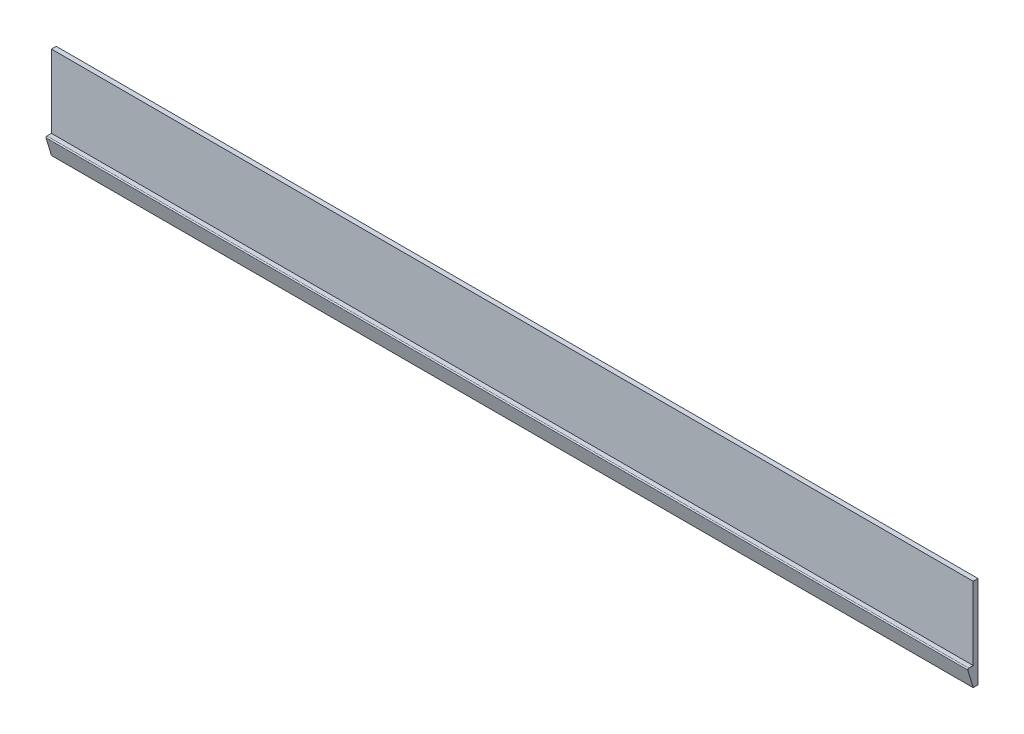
ISO-10303-21;
HEADER;
FILE_DESCRIPTION(('STEP AP214'),'2;1');
FILE_NAME('part.step','',(''),(''),'','','');
FILE_SCHEMA(('AUTOMOTIVE_DESIGN { 1 0 10303 214 1 1 1 1 }'));
ENDSEC;
DATA;
#1=APPLICATION_CONTEXT('core data for automotive mechanical design processes');
#2=APPLICATION_PROTOCOL_DEFINITION('international standard','automotive_design',2000,#1);
#3=PRODUCT_CONTEXT('',#1,'mechanical');
#4=PRODUCT('Part','Part','',(#3));
#5=PRODUCT_RELATED_PRODUCT_CATEGORY('part','',(#4));
#6=PRODUCT_DEFINITION_FORMATION('','',#4);
#7=PRODUCT_DEFINITION_CONTEXT('part definition',#1,'design');
#8=PRODUCT_DEFINITION('design','',#6,#7);
#9=PRODUCT_DEFINITION_SHAPE('','',#8);
#10=(LENGTH_UNIT() NAMED_UNIT(*) SI_UNIT(.MILLI.,.METRE.));
#11=(NAMED_UNIT(*) PLANE_ANGLE_UNIT() SI_UNIT($,.RADIAN.));
#12=(NAMED_UNIT(*) SI_UNIT($,.STERADIAN.) SOLID_ANGLE_UNIT());
#13=UNCERTAINTY_MEASURE_WITH_UNIT(LENGTH_MEASURE(1.E-05),#10,'distance_accuracy_value','');
#14=(GEOMETRIC_REPRESENTATION_CONTEXT(3) GLOBAL_UNCERTAINTY_ASSIGNED_CONTEXT((#13)) GLOBAL_UNIT_ASSIGNED_CONTEXT((#10,
#11,#12)) REPRESENTATION_CONTEXT('',''));
#15=CARTESIAN_POINT('',(0.,0.,0.));
#16=DIRECTION('',(0.,0.,1.));
#17=DIRECTION('',(1.,0.,0.));
#18=AXIS2_PLACEMENT_3D('',#15,#16,#17);
#19=CARTESIAN_POINT('',(240.,24.,-1.25));
#20=DIRECTION('',(0.,0.,1.));
#21=DIRECTION('',(0.,-1.,0.));
#22=AXIS2_PLACEMENT_3D('',#19,#20,#21);
#23=PLANE('',#22);
#24=DIRECTION('',(0.,1.,0.));
#25=VECTOR('',#24,1.);
#26=CARTESIAN_POINT('',(-240.,24.,-1.25));
#27=LINE('',#26,#25);
#28=CARTESIAN_POINT('',(-240.,-24.,-1.25));
#29=VERTEX_POINT('',#28);
#30=CARTESIAN_POINT('',(-240.,24.,-1.25));
#31=VERTEX_POINT('',#30);
#32=EDGE_CURVE('E123',#29,#31,#27,.T.);
#33=ORIENTED_EDGE('',*,*,#32,.T.);
#34=DIRECTION('',(-1.,0.,0.));
#35=VECTOR('',#34,1.);
#36=CARTESIAN_POINT('',(240.,24.,-1.25));
#37=LINE('',#36,#35);
#38=CARTESIAN_POINT('',(240.,24.,-1.25));
#39=VERTEX_POINT('',#38);
#40=EDGE_CURVE('E102',#39,#31,#37,.T.);
#41=ORIENTED_EDGE('',*,*,#40,.F.);
#42=DIRECTION('',(0.,1.,0.));
#43=VECTOR('',#42,1.);
#44=CARTESIAN_POINT('',(240.,24.,-1.25));
#45=LINE('',#44,#43);
#46=CARTESIAN_POINT('',(240.,-24.,-1.25));
#47=VERTEX_POINT('',#46);
#48=EDGE_CURVE('E110',#47,#39,#45,.T.);
#49=ORIENTED_EDGE('',*,*,#48,.F.);
#50=DIRECTION('',(-1.,0.,0.));
#51=VECTOR('',#50,1.);
#52=CARTESIAN_POINT('',(240.,-24.,-1.25));
#53=LINE('',#52,#51);
#54=EDGE_CURVE('E144',#47,#29,#53,.T.);
#55=ORIENTED_EDGE('',*,*,#54,.T.);
#56=EDGE_LOOP('',(#33,#41,#49,#55));
#57=FACE_BOUND('',#56,.T.);
#58=ADVANCED_FACE('F38',(#57),#23,.F.);
#59=CARTESIAN_POINT('',(240.,24.,1.25));
#60=DIRECTION('',(0.,-1.,0.));
#61=DIRECTION('',(0.,0.,-1.));
#62=AXIS2_PLACEMENT_3D('',#59,#60,#61);
#63=PLANE('',#62);
#64=DIRECTION('',(0.,0.,1.));
#65=VECTOR('',#64,1.);
#66=CARTESIAN_POINT('',(-240.,24.,1.25));
#67=LINE('',#66,#65);
#68=CARTESIAN_POINT('',(-240.,24.,1.25));
#69=VERTEX_POINT('',#68);
#70=EDGE_CURVE('E158',#31,#69,#67,.T.);
#71=ORIENTED_EDGE('',*,*,#70,.T.);
#72=DIRECTION('',(-1.,0.,0.));
#73=VECTOR('',#72,1.);
#74=CARTESIAN_POINT('',(240.,24.,1.25));
#75=LINE('',#74,#73);
#76=CARTESIAN_POINT('',(240.,24.,1.25));
#77=VERTEX_POINT('',#76);
#78=EDGE_CURVE('E105',#77,#69,#75,.T.);
#79=ORIENTED_EDGE('',*,*,#78,.F.);
#80=DIRECTION('',(0.,0.,1.));
#81=VECTOR('',#80,1.);
#82=CARTESIAN_POINT('',(240.,24.,1.25));
#83=LINE('',#82,#81);
#84=EDGE_CURVE('E98',#39,#77,#83,.T.);
#85=ORIENTED_EDGE('',*,*,#84,.F.);
#86=ORIENTED_EDGE('',*,*,#40,.T.);
#87=EDGE_LOOP('',(#71,#79,#85,#86));
#88=FACE_BOUND('',#87,.T.);
#89=ADVANCED_FACE('F100',(#88),#63,.F.);
#90=CARTESIAN_POINT('',(240.,24.,1.25));
#91=DIRECTION('',(0.,0.,-1.));
#92=DIRECTION('',(0.,1.,0.));
#93=AXIS2_PLACEMENT_3D('',#90,#91,#92);
#94=PLANE('',#93);
#95=DIRECTION('',(0.,-1.,0.));
#96=VECTOR('',#95,1.);
#97=CARTESIAN_POINT('',(-240.,24.,1.25));
#98=LINE('',#97,#96);
#99=CARTESIAN_POINT('',(-240.,-14.,1.25));
#100=VERTEX_POINT('',#99);
#101=EDGE_CURVE('E155',#69,#100,#98,.T.);
#102=ORIENTED_EDGE('',*,*,#101,.T.);
#103=DIRECTION('',(-1.,0.,0.));
#104=VECTOR('',#103,1.);
#105=CARTESIAN_POINT('',(240.,-14.,1.25));
#106=LINE('',#105,#104);
#107=CARTESIAN_POINT('',(240.,-14.,1.25));
#108=VERTEX_POINT('',#107);
#109=EDGE_CURVE('E131',#108,#100,#106,.T.);
#110=ORIENTED_EDGE('',*,*,#109,.F.);
#111=DIRECTION('',(0.,-1.,0.));
#112=VECTOR('',#111,1.);
#113=CARTESIAN_POINT('',(240.,24.,1.25));
#114=LINE('',#113,#112);
#115=EDGE_CURVE('E109',#77,#108,#114,.T.);
#116=ORIENTED_EDGE('',*,*,#115,.F.);
#117=ORIENTED_EDGE('',*,*,#78,.T.);
#118=EDGE_LOOP('',(#102,#110,#116,#117));
#119=FACE_BOUND('',#118,.T.);
#120=ADVANCED_FACE('F175',(#119),#94,.F.);
#121=CARTESIAN_POINT('',(240.,-14.,1.25));
#122=DIRECTION('',(0.,-1.,0.));
#123=DIRECTION('',(0.,0.,-1.));
#124=AXIS2_PLACEMENT_3D('',#121,#122,#123);
#125=PLANE('',#124);
#126=DIRECTION('',(0.,0.,1.));
#127=VECTOR('',#126,1.);
#128=CARTESIAN_POINT('',(-240.,-14.,1.25));
#129=LINE('',#128,#127);
#130=CARTESIAN_POINT('',(-240.,-14.,3.57798467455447));
#131=VERTEX_POINT('',#130);
#132=EDGE_CURVE('E152',#100,#131,#129,.T.);
#133=ORIENTED_EDGE('',*,*,#132,.T.);
#134=DIRECTION('',(-1.,0.,0.));
#135=VECTOR('',#134,1.);
#136=CARTESIAN_POINT('',(240.,-14.,3.57798467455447));
#137=LINE('',#136,#135);
#138=CARTESIAN_POINT('',(240.,-14.,3.57798467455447));
#139=VERTEX_POINT('',#138);
#140=EDGE_CURVE('E47',#131,#139,#137,.F.);
#141=ORIENTED_EDGE('',*,*,#140,.T.);
#142=DIRECTION('',(0.,0.,1.));
#143=VECTOR('',#142,1.);
#144=CARTESIAN_POINT('',(240.,-14.,1.25));
#145=LINE('',#144,#143);
#146=EDGE_CURVE('E168',#108,#139,#145,.T.);
#147=ORIENTED_EDGE('',*,*,#146,.F.);
#148=ORIENTED_EDGE('',*,*,#109,.T.);
#149=EDGE_LOOP('',(#133,#141,#147,#148));
#150=FACE_BOUND('',#149,.T.);
#151=ADVANCED_FACE('F177',(#150),#125,.F.);
#152=CARTESIAN_POINT('',(240.,-14.,4.25));
#153=DIRECTION('',(0.,0.287347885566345,-0.957826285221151));
#154=DIRECTION('',(0.,0.957826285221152,0.287347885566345));
#155=AXIS2_PLACEMENT_3D('',#152,#153,#154);
#156=PLANE('',#155);
#157=DIRECTION('',(0.,-0.957826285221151,-0.287347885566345));
#158=VECTOR('',#157,1.);
#159=CARTESIAN_POINT('',(240.,-14.,4.25));
#160=LINE('',#159,#158);
#161=CARTESIAN_POINT('',(240.,-14.6436739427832,4.05689781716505));
#162=VERTEX_POINT('',#161);
#163=CARTESIAN_POINT('',(240.,-24.,1.25));
#164=VERTEX_POINT('',#163);
#165=EDGE_CURVE('E165',#162,#164,#160,.T.);
#166=ORIENTED_EDGE('',*,*,#165,.F.);
#167=DIRECTION('',(-1.,0.,0.));
#168=VECTOR('',#167,1.);
#169=CARTESIAN_POINT('',(240.,-14.6436739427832,4.05689781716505));
#170=LINE('',#169,#168);
#171=CARTESIAN_POINT('',(-240.,-14.6436739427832,4.05689781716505));
#172=VERTEX_POINT('',#171);
#173=EDGE_CURVE('E125',#162,#172,#170,.T.);
#174=ORIENTED_EDGE('',*,*,#173,.T.);
#175=DIRECTION('',(0.,-0.957826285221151,-0.287347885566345));
#176=VECTOR('',#175,1.);
#177=CARTESIAN_POINT('',(-240.,-14.,4.25));
#178=LINE('',#177,#176);
#179=CARTESIAN_POINT('',(-240.,-24.,1.25));
#180=VERTEX_POINT('',#179);
#181=EDGE_CURVE('E149',#172,#180,#178,.T.);
#182=ORIENTED_EDGE('',*,*,#181,.T.);
#183=DIRECTION('',(-1.,0.,0.));
#184=VECTOR('',#183,1.);
#185=CARTESIAN_POINT('',(240.,-24.,1.25));
#186=LINE('',#185,#184);
#187=EDGE_CURVE('E140',#164,#180,#186,.T.);
#188=ORIENTED_EDGE('',*,*,#187,.F.);
#189=EDGE_LOOP('',(#166,#174,#182,#188));
#190=FACE_BOUND('',#189,.T.);
#191=ADVANCED_FACE('F179',(#190),#156,.F.);
#192=CARTESIAN_POINT('',(240.,-24.,1.25));
#193=DIRECTION('',(0.,1.,0.));
#194=DIRECTION('',(0.,0.,1.));
#195=AXIS2_PLACEMENT_3D('',#192,#193,#194);
#196=PLANE('',#195);
#197=DIRECTION('',(0.,0.,-1.));
#198=VECTOR('',#197,1.);
#199=CARTESIAN_POINT('',(-240.,-24.,1.25));
#200=LINE('',#199,#198);
#201=EDGE_CURVE('E120',#180,#29,#200,.T.);
#202=ORIENTED_EDGE('',*,*,#201,.T.);
#203=ORIENTED_EDGE('',*,*,#54,.F.);
#204=DIRECTION('',(0.,0.,-1.));
#205=VECTOR('',#204,1.);
#206=CARTESIAN_POINT('',(240.,-24.,1.25));
#207=LINE('',#206,#205);
#208=EDGE_CURVE('E115',#164,#47,#207,.T.);
#209=ORIENTED_EDGE('',*,*,#208,.F.);
#210=ORIENTED_EDGE('',*,*,#187,.T.);
#211=EDGE_LOOP('',(#202,#203,#209,#210));
#212=FACE_BOUND('',#211,.T.);
#213=ADVANCED_FACE('F185',(#212),#196,.F.);
#214=CARTESIAN_POINT('',(240.,0.,0.));
#215=DIRECTION('',(1.,0.,0.));
#216=DIRECTION('',(0.,0.,-1.));
#217=AXIS2_PLACEMENT_3D('',#214,#215,#216);
#218=PLANE('',#217);
#219=ORIENTED_EDGE('',*,*,#146,.T.);
#220=CARTESIAN_POINT('',(240.,-14.5,3.57798467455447));
#221=DIRECTION('',(1.,0.,0.));
#222=DIRECTION('',(0.,0.,-1.));
#223=AXIS2_PLACEMENT_3D('',#220,#221,#222);
#224=CIRCLE('',#223,0.5);
#225=EDGE_CURVE('E11',#139,#162,#224,.T.);
#226=ORIENTED_EDGE('',*,*,#225,.T.);
#227=ORIENTED_EDGE('',*,*,#165,.T.);
#228=ORIENTED_EDGE('',*,*,#208,.T.);
#229=ORIENTED_EDGE('',*,*,#48,.T.);
#230=ORIENTED_EDGE('',*,*,#84,.T.);
#231=ORIENTED_EDGE('',*,*,#115,.T.);
#232=EDGE_LOOP('',(#219,#226,#227,#228,#229,#230,#231));
#233=FACE_BOUND('',#232,.T.);
#234=ADVANCED_FACE('F113',(#233),#218,.T.);
#235=CARTESIAN_POINT('',(-240.,0.,0.));
#236=DIRECTION('',(1.,0.,0.));
#237=DIRECTION('',(0.,0.,-1.));
#238=AXIS2_PLACEMENT_3D('',#235,#236,#237);
#239=PLANE('',#238);
#240=ORIENTED_EDGE('',*,*,#181,.F.);
#241=CARTESIAN_POINT('',(-240.,-14.5,3.57798467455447));
#242=DIRECTION('',(1.,0.,0.));
#243=DIRECTION('',(0.,0.,-1.));
#244=AXIS2_PLACEMENT_3D('',#241,#242,#243);
#245=CIRCLE('',#244,0.5);
#246=EDGE_CURVE('E61',#172,#131,#245,.F.);
#247=ORIENTED_EDGE('',*,*,#246,.T.);
#248=ORIENTED_EDGE('',*,*,#132,.F.);
#249=ORIENTED_EDGE('',*,*,#101,.F.);
#250=ORIENTED_EDGE('',*,*,#70,.F.);
#251=ORIENTED_EDGE('',*,*,#32,.F.);
#252=ORIENTED_EDGE('',*,*,#201,.F.);
#253=EDGE_LOOP('',(#240,#247,#248,#249,#250,#251,#252));
#254=FACE_BOUND('',#253,.T.);
#255=ADVANCED_FACE('F224',(#254),#239,.F.);
#256=CARTESIAN_POINT('',(240.,-14.5,3.57798467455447));
#257=DIRECTION('',(-1.,0.,0.));
#258=DIRECTION('',(0.,0.,1.));
#259=AXIS2_PLACEMENT_3D('',#256,#257,#258);
#260=CYLINDRICAL_SURFACE('',#259,0.5);
#261=ORIENTED_EDGE('',*,*,#225,.F.);
#262=ORIENTED_EDGE('',*,*,#140,.F.);
#263=ORIENTED_EDGE('',*,*,#246,.F.);
#264=ORIENTED_EDGE('',*,*,#173,.F.);
#265=EDGE_LOOP('',(#261,#262,#263,#264));
#266=FACE_BOUND('',#265,.T.);
#267=ADVANCED_FACE('F40',(#266),#260,.T.);
#268=CLOSED_SHELL('',(#58,#89,#120,#151,#191,#213,#234,#255,#267));
#269=MANIFOLD_SOLID_BREP('B2',#268);
#270=ADVANCED_BREP_SHAPE_REPRESENTATION('',(#18,#269),#14);
#271=SHAPE_DEFINITION_REPRESENTATION(#9,#270);
ENDSEC;
END-ISO-10303-21;
